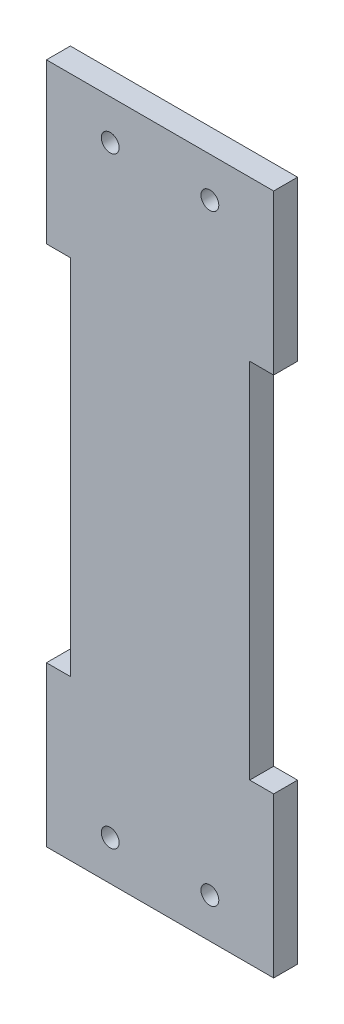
ISO-10303-21;
HEADER;
FILE_DESCRIPTION(('STEP AP214'),'2;1');
FILE_NAME('part.step','',(''),(''),'','','');
FILE_SCHEMA(('AUTOMOTIVE_DESIGN { 1 0 10303 214 1 1 1 1 }'));
ENDSEC;
DATA;
#1=APPLICATION_CONTEXT('core data for automotive mechanical design processes');
#2=APPLICATION_PROTOCOL_DEFINITION('international standard','automotive_design',2000,#1);
#3=PRODUCT_CONTEXT('',#1,'mechanical');
#4=PRODUCT('Part','Part','',(#3));
#5=PRODUCT_RELATED_PRODUCT_CATEGORY('part','',(#4));
#6=PRODUCT_DEFINITION_FORMATION('','',#4);
#7=PRODUCT_DEFINITION_CONTEXT('part definition',#1,'design');
#8=PRODUCT_DEFINITION('design','',#6,#7);
#9=PRODUCT_DEFINITION_SHAPE('','',#8);
#10=(LENGTH_UNIT() NAMED_UNIT(*) SI_UNIT(.MILLI.,.METRE.));
#11=(NAMED_UNIT(*) PLANE_ANGLE_UNIT() SI_UNIT($,.RADIAN.));
#12=(NAMED_UNIT(*) SI_UNIT($,.STERADIAN.) SOLID_ANGLE_UNIT());
#13=UNCERTAINTY_MEASURE_WITH_UNIT(LENGTH_MEASURE(1.E-05),#10,'distance_accuracy_value','');
#14=(GEOMETRIC_REPRESENTATION_CONTEXT(3) GLOBAL_UNCERTAINTY_ASSIGNED_CONTEXT((#13)) GLOBAL_UNIT_ASSIGNED_CONTEXT((#10,
#11,#12)) REPRESENTATION_CONTEXT('',''));
#15=CARTESIAN_POINT('',(0.,0.,0.));
#16=DIRECTION('',(0.,0.,1.));
#17=DIRECTION('',(1.,0.,0.));
#18=AXIS2_PLACEMENT_3D('',#15,#16,#17);
#19=CARTESIAN_POINT('',(0.,0.,6.));
#20=DIRECTION('',(0.,0.,1.));
#21=DIRECTION('',(1.,0.,0.));
#22=AXIS2_PLACEMENT_3D('',#19,#20,#21);
#23=PLANE('',#22);
#24=CARTESIAN_POINT('',(12.5,-75.5,6.));
#25=DIRECTION('',(0.,0.,-1.));
#26=DIRECTION('',(-1.,0.,0.));
#27=AXIS2_PLACEMENT_3D('',#24,#25,#26);
#28=CIRCLE('',#27,2.23466812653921);
#29=CARTESIAN_POINT('',(10.2653318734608,-75.5,6.));
#30=VERTEX_POINT('',#29);
#31=EDGE_CURVE('E188',#30,#30,#28,.T.);
#32=ORIENTED_EDGE('',*,*,#31,.T.);
#33=EDGE_LOOP('',(#32));
#34=FACE_BOUND('',#33,.T.);
#35=CARTESIAN_POINT('',(-12.5,-75.5,6.));
#36=DIRECTION('',(0.,0.,1.));
#37=DIRECTION('',(1.,0.,0.));
#38=AXIS2_PLACEMENT_3D('',#35,#36,#37);
#39=CIRCLE('',#38,2.23466812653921);
#40=CARTESIAN_POINT('',(-10.2653318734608,-75.5,6.));
#41=VERTEX_POINT('',#40);
#42=EDGE_CURVE('E187',#41,#41,#39,.T.);
#43=ORIENTED_EDGE('',*,*,#42,.F.);
#44=EDGE_LOOP('',(#43));
#45=FACE_BOUND('',#44,.T.);
#46=DIRECTION('',(1.,0.,0.));
#47=VECTOR('',#46,1.);
#48=CARTESIAN_POINT('',(-22.5,-85.5,6.));
#49=LINE('',#48,#47);
#50=CARTESIAN_POINT('',(-28.5,-85.5,6.));
#51=VERTEX_POINT('',#50);
#52=CARTESIAN_POINT('',(28.5,-85.5,6.));
#53=VERTEX_POINT('',#52);
#54=EDGE_CURVE('E11',#51,#53,#49,.T.);
#55=ORIENTED_EDGE('',*,*,#54,.T.);
#56=DIRECTION('',(0.,1.,0.));
#57=VECTOR('',#56,1.);
#58=CARTESIAN_POINT('',(28.5,-85.5,6.));
#59=LINE('',#58,#57);
#60=CARTESIAN_POINT('',(28.5,-45.5,6.));
#61=VERTEX_POINT('',#60);
#62=EDGE_CURVE('E257',#53,#61,#59,.T.);
#63=ORIENTED_EDGE('',*,*,#62,.T.);
#64=DIRECTION('',(-1.,0.,0.));
#65=VECTOR('',#64,1.);
#66=CARTESIAN_POINT('',(22.5,-45.5,6.));
#67=LINE('',#66,#65);
#68=CARTESIAN_POINT('',(22.5,-45.5,6.));
#69=VERTEX_POINT('',#68);
#70=EDGE_CURVE('E230',#61,#69,#67,.T.);
#71=ORIENTED_EDGE('',*,*,#70,.T.);
#72=DIRECTION('',(0.,1.,0.));
#73=VECTOR('',#72,1.);
#74=CARTESIAN_POINT('',(22.5,85.5,6.));
#75=LINE('',#74,#73);
#76=CARTESIAN_POINT('',(22.5,45.5,6.));
#77=VERTEX_POINT('',#76);
#78=EDGE_CURVE('E37',#69,#77,#75,.T.);
#79=ORIENTED_EDGE('',*,*,#78,.T.);
#80=DIRECTION('',(-1.,0.,0.));
#81=VECTOR('',#80,1.);
#82=CARTESIAN_POINT('',(22.5,45.5,6.));
#83=LINE('',#82,#81);
#84=CARTESIAN_POINT('',(28.5,45.5,6.));
#85=VERTEX_POINT('',#84);
#86=EDGE_CURVE('E171',#85,#77,#83,.T.);
#87=ORIENTED_EDGE('',*,*,#86,.F.);
#88=DIRECTION('',(0.,-1.,0.));
#89=VECTOR('',#88,1.);
#90=CARTESIAN_POINT('',(28.5,85.5,6.));
#91=LINE('',#90,#89);
#92=CARTESIAN_POINT('',(28.5,85.5,6.));
#93=VERTEX_POINT('',#92);
#94=EDGE_CURVE('E168',#93,#85,#91,.T.);
#95=ORIENTED_EDGE('',*,*,#94,.F.);
#96=DIRECTION('',(-1.,0.,0.));
#97=VECTOR('',#96,1.);
#98=CARTESIAN_POINT('',(-22.5,85.5,6.));
#99=LINE('',#98,#97);
#100=CARTESIAN_POINT('',(-28.5,85.5,6.));
#101=VERTEX_POINT('',#100);
#102=EDGE_CURVE('E221',#93,#101,#99,.T.);
#103=ORIENTED_EDGE('',*,*,#102,.T.);
#104=DIRECTION('',(0.,-1.,0.));
#105=VECTOR('',#104,1.);
#106=CARTESIAN_POINT('',(-28.5,85.5,6.));
#107=LINE('',#106,#105);
#108=CARTESIAN_POINT('',(-28.5,45.5,6.));
#109=VERTEX_POINT('',#108);
#110=EDGE_CURVE('E195',#101,#109,#107,.T.);
#111=ORIENTED_EDGE('',*,*,#110,.T.);
#112=DIRECTION('',(1.,0.,0.));
#113=VECTOR('',#112,1.);
#114=CARTESIAN_POINT('',(-22.5,45.5,6.));
#115=LINE('',#114,#113);
#116=CARTESIAN_POINT('',(-22.5,45.5,6.));
#117=VERTEX_POINT('',#116);
#118=EDGE_CURVE('E202',#109,#117,#115,.T.);
#119=ORIENTED_EDGE('',*,*,#118,.T.);
#120=DIRECTION('',(0.,-1.,0.));
#121=VECTOR('',#120,1.);
#122=CARTESIAN_POINT('',(-22.5,85.5,6.));
#123=LINE('',#122,#121);
#124=CARTESIAN_POINT('',(-22.5,-45.5,6.));
#125=VERTEX_POINT('',#124);
#126=EDGE_CURVE('E43',#117,#125,#123,.T.);
#127=ORIENTED_EDGE('',*,*,#126,.T.);
#128=DIRECTION('',(1.,0.,0.));
#129=VECTOR('',#128,1.);
#130=CARTESIAN_POINT('',(-22.5,-45.5,6.));
#131=LINE('',#130,#129);
#132=CARTESIAN_POINT('',(-28.5,-45.5,6.));
#133=VERTEX_POINT('',#132);
#134=EDGE_CURVE('E140',#133,#125,#131,.T.);
#135=ORIENTED_EDGE('',*,*,#134,.F.);
#136=DIRECTION('',(0.,1.,0.));
#137=VECTOR('',#136,1.);
#138=CARTESIAN_POINT('',(-28.5,-85.5,6.));
#139=LINE('',#138,#137);
#140=EDGE_CURVE('E134',#51,#133,#139,.T.);
#141=ORIENTED_EDGE('',*,*,#140,.F.);
#142=EDGE_LOOP('',(#55,#63,#71,#79,#87,#95,#103,#111,#119,#127,#135,#141));
#143=FACE_BOUND('',#142,.T.);
#144=CARTESIAN_POINT('',(12.5,75.5,6.));
#145=DIRECTION('',(0.,0.,1.));
#146=DIRECTION('',(-1.,0.,0.));
#147=AXIS2_PLACEMENT_3D('',#144,#145,#146);
#148=CIRCLE('',#147,2.23466812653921);
#149=CARTESIAN_POINT('',(10.2653318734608,75.5,6.));
#150=VERTEX_POINT('',#149);
#151=EDGE_CURVE('E270',#150,#150,#148,.T.);
#152=ORIENTED_EDGE('',*,*,#151,.F.);
#153=EDGE_LOOP('',(#152));
#154=FACE_BOUND('',#153,.T.);
#155=CARTESIAN_POINT('',(-12.5,75.5,6.));
#156=DIRECTION('',(0.,0.,-1.));
#157=DIRECTION('',(1.,0.,0.));
#158=AXIS2_PLACEMENT_3D('',#155,#156,#157);
#159=CIRCLE('',#158,2.23466812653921);
#160=CARTESIAN_POINT('',(-10.2653318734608,75.5,6.));
#161=VERTEX_POINT('',#160);
#162=EDGE_CURVE('E276',#161,#161,#159,.T.);
#163=ORIENTED_EDGE('',*,*,#162,.T.);
#164=EDGE_LOOP('',(#163));
#165=FACE_BOUND('',#164,.T.);
#166=ADVANCED_FACE('F33',(#34,#45,#143,#154,#165),#23,.T.);
#167=CARTESIAN_POINT('',(0.,0.,0.));
#168=DIRECTION('',(0.,0.,1.));
#169=DIRECTION('',(1.,0.,0.));
#170=AXIS2_PLACEMENT_3D('',#167,#168,#169);
#171=PLANE('',#170);
#172=CARTESIAN_POINT('',(12.5,-75.5,0.));
#173=DIRECTION('',(0.,0.,-1.));
#174=DIRECTION('',(-1.,0.,0.));
#175=AXIS2_PLACEMENT_3D('',#172,#173,#174);
#176=CIRCLE('',#175,2.23466812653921);
#177=CARTESIAN_POINT('',(10.2653318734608,-75.5,0.));
#178=VERTEX_POINT('',#177);
#179=EDGE_CURVE('E184',#178,#178,#176,.T.);
#180=ORIENTED_EDGE('',*,*,#179,.F.);
#181=EDGE_LOOP('',(#180));
#182=FACE_BOUND('',#181,.T.);
#183=CARTESIAN_POINT('',(-12.5,-75.5,0.));
#184=DIRECTION('',(0.,0.,1.));
#185=DIRECTION('',(1.,0.,0.));
#186=AXIS2_PLACEMENT_3D('',#183,#184,#185);
#187=CIRCLE('',#186,2.23466812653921);
#188=CARTESIAN_POINT('',(-10.2653318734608,-75.5,0.));
#189=VERTEX_POINT('',#188);
#190=EDGE_CURVE('E192',#189,#189,#187,.T.);
#191=ORIENTED_EDGE('',*,*,#190,.T.);
#192=EDGE_LOOP('',(#191));
#193=FACE_BOUND('',#192,.T.);
#194=DIRECTION('',(0.,1.,0.));
#195=VECTOR('',#194,1.);
#196=CARTESIAN_POINT('',(22.5,85.5,0.));
#197=LINE('',#196,#195);
#198=CARTESIAN_POINT('',(22.5,-45.5,0.));
#199=VERTEX_POINT('',#198);
#200=CARTESIAN_POINT('',(22.5,45.5,0.));
#201=VERTEX_POINT('',#200);
#202=EDGE_CURVE('E152',#199,#201,#197,.T.);
#203=ORIENTED_EDGE('',*,*,#202,.F.);
#204=DIRECTION('',(-1.,0.,0.));
#205=VECTOR('',#204,1.);
#206=CARTESIAN_POINT('',(22.5,-45.5,0.));
#207=LINE('',#206,#205);
#208=CARTESIAN_POINT('',(28.5,-45.5,0.));
#209=VERTEX_POINT('',#208);
#210=EDGE_CURVE('E252',#209,#199,#207,.T.);
#211=ORIENTED_EDGE('',*,*,#210,.F.);
#212=DIRECTION('',(0.,1.,0.));
#213=VECTOR('',#212,1.);
#214=CARTESIAN_POINT('',(28.5,-85.5,0.));
#215=LINE('',#214,#213);
#216=CARTESIAN_POINT('',(28.5,-85.5,0.));
#217=VERTEX_POINT('',#216);
#218=EDGE_CURVE('E256',#217,#209,#215,.T.);
#219=ORIENTED_EDGE('',*,*,#218,.F.);
#220=DIRECTION('',(1.,0.,0.));
#221=VECTOR('',#220,1.);
#222=CARTESIAN_POINT('',(-22.5,-85.5,0.));
#223=LINE('',#222,#221);
#224=CARTESIAN_POINT('',(-28.5,-85.5,0.));
#225=VERTEX_POINT('',#224);
#226=EDGE_CURVE('E148',#225,#217,#223,.T.);
#227=ORIENTED_EDGE('',*,*,#226,.F.);
#228=DIRECTION('',(0.,1.,0.));
#229=VECTOR('',#228,1.);
#230=CARTESIAN_POINT('',(-28.5,-85.5,0.));
#231=LINE('',#230,#229);
#232=CARTESIAN_POINT('',(-28.5,-45.5,0.));
#233=VERTEX_POINT('',#232);
#234=EDGE_CURVE('E130',#225,#233,#231,.T.);
#235=ORIENTED_EDGE('',*,*,#234,.T.);
#236=DIRECTION('',(1.,0.,0.));
#237=VECTOR('',#236,1.);
#238=CARTESIAN_POINT('',(-22.5,-45.5,0.));
#239=LINE('',#238,#237);
#240=CARTESIAN_POINT('',(-22.5,-45.5,0.));
#241=VERTEX_POINT('',#240);
#242=EDGE_CURVE('E121',#233,#241,#239,.T.);
#243=ORIENTED_EDGE('',*,*,#242,.T.);
#244=DIRECTION('',(0.,-1.,0.));
#245=VECTOR('',#244,1.);
#246=CARTESIAN_POINT('',(-22.5,85.5,0.));
#247=LINE('',#246,#245);
#248=CARTESIAN_POINT('',(-22.5,45.5,0.));
#249=VERTEX_POINT('',#248);
#250=EDGE_CURVE('E127',#249,#241,#247,.T.);
#251=ORIENTED_EDGE('',*,*,#250,.F.);
#252=DIRECTION('',(1.,0.,0.));
#253=VECTOR('',#252,1.);
#254=CARTESIAN_POINT('',(-22.5,45.5,0.));
#255=LINE('',#254,#253);
#256=CARTESIAN_POINT('',(-28.5,45.5,0.));
#257=VERTEX_POINT('',#256);
#258=EDGE_CURVE('E201',#257,#249,#255,.T.);
#259=ORIENTED_EDGE('',*,*,#258,.F.);
#260=DIRECTION('',(0.,-1.,0.));
#261=VECTOR('',#260,1.);
#262=CARTESIAN_POINT('',(-28.5,85.5,0.));
#263=LINE('',#262,#261);
#264=CARTESIAN_POINT('',(-28.5,85.5,0.));
#265=VERTEX_POINT('',#264);
#266=EDGE_CURVE('E198',#265,#257,#263,.T.);
#267=ORIENTED_EDGE('',*,*,#266,.F.);
#268=DIRECTION('',(-1.,0.,0.));
#269=VECTOR('',#268,1.);
#270=CARTESIAN_POINT('',(-22.5,85.5,0.));
#271=LINE('',#270,#269);
#272=CARTESIAN_POINT('',(28.5,85.5,0.));
#273=VERTEX_POINT('',#272);
#274=EDGE_CURVE('E149',#273,#265,#271,.T.);
#275=ORIENTED_EDGE('',*,*,#274,.F.);
#276=DIRECTION('',(0.,-1.,0.));
#277=VECTOR('',#276,1.);
#278=CARTESIAN_POINT('',(28.5,85.5,0.));
#279=LINE('',#278,#277);
#280=CARTESIAN_POINT('',(28.5,45.5,0.));
#281=VERTEX_POINT('',#280);
#282=EDGE_CURVE('E167',#273,#281,#279,.T.);
#283=ORIENTED_EDGE('',*,*,#282,.T.);
#284=DIRECTION('',(-1.,0.,0.));
#285=VECTOR('',#284,1.);
#286=CARTESIAN_POINT('',(22.5,45.5,0.));
#287=LINE('',#286,#285);
#288=EDGE_CURVE('E164',#281,#201,#287,.T.);
#289=ORIENTED_EDGE('',*,*,#288,.T.);
#290=EDGE_LOOP('',(#203,#211,#219,#227,#235,#243,#251,#259,#267,#275,#283,#289));
#291=FACE_BOUND('',#290,.T.);
#292=CARTESIAN_POINT('',(12.5,75.5,0.));
#293=DIRECTION('',(0.,0.,1.));
#294=DIRECTION('',(-1.,0.,0.));
#295=AXIS2_PLACEMENT_3D('',#292,#293,#294);
#296=CIRCLE('',#295,2.23466812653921);
#297=CARTESIAN_POINT('',(10.2653318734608,75.5,0.));
#298=VERTEX_POINT('',#297);
#299=EDGE_CURVE('E268',#298,#298,#296,.T.);
#300=ORIENTED_EDGE('',*,*,#299,.T.);
#301=EDGE_LOOP('',(#300));
#302=FACE_BOUND('',#301,.T.);
#303=CARTESIAN_POINT('',(-12.5,75.5,0.));
#304=DIRECTION('',(0.,0.,-1.));
#305=DIRECTION('',(1.,0.,0.));
#306=AXIS2_PLACEMENT_3D('',#303,#304,#305);
#307=CIRCLE('',#306,2.23466812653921);
#308=CARTESIAN_POINT('',(-10.2653318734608,75.5,0.));
#309=VERTEX_POINT('',#308);
#310=EDGE_CURVE('E273',#309,#309,#307,.T.);
#311=ORIENTED_EDGE('',*,*,#310,.F.);
#312=EDGE_LOOP('',(#311));
#313=FACE_BOUND('',#312,.T.);
#314=ADVANCED_FACE('F123',(#182,#193,#291,#302,#313),#171,.F.);
#315=CARTESIAN_POINT('',(-22.5,85.5,6.));
#316=DIRECTION('',(1.,0.,0.));
#317=DIRECTION('',(0.,1.,0.));
#318=AXIS2_PLACEMENT_3D('',#315,#316,#317);
#319=PLANE('',#318);
#320=DIRECTION('',(0.,0.,1.));
#321=VECTOR('',#320,1.);
#322=CARTESIAN_POINT('',(-22.5,-45.5,0.));
#323=LINE('',#322,#321);
#324=EDGE_CURVE('E137',#241,#125,#323,.T.);
#325=ORIENTED_EDGE('',*,*,#324,.T.);
#326=ORIENTED_EDGE('',*,*,#126,.F.);
#327=DIRECTION('',(0.,0.,1.));
#328=VECTOR('',#327,1.);
#329=CARTESIAN_POINT('',(-22.5,45.5,0.));
#330=LINE('',#329,#328);
#331=EDGE_CURVE('E147',#249,#117,#330,.T.);
#332=ORIENTED_EDGE('',*,*,#331,.F.);
#333=ORIENTED_EDGE('',*,*,#250,.T.);
#334=EDGE_LOOP('',(#325,#326,#332,#333));
#335=FACE_BOUND('',#334,.T.);
#336=ADVANCED_FACE('F145',(#335),#319,.F.);
#337=CARTESIAN_POINT('',(22.5,85.5,6.));
#338=DIRECTION('',(-1.,0.,0.));
#339=DIRECTION('',(0.,-1.,0.));
#340=AXIS2_PLACEMENT_3D('',#337,#338,#339);
#341=PLANE('',#340);
#342=ORIENTED_EDGE('',*,*,#78,.F.);
#343=DIRECTION('',(0.,0.,1.));
#344=VECTOR('',#343,1.);
#345=CARTESIAN_POINT('',(22.5,-45.5,0.));
#346=LINE('',#345,#344);
#347=EDGE_CURVE('E54',#199,#69,#346,.T.);
#348=ORIENTED_EDGE('',*,*,#347,.F.);
#349=ORIENTED_EDGE('',*,*,#202,.T.);
#350=DIRECTION('',(0.,0.,1.));
#351=VECTOR('',#350,1.);
#352=CARTESIAN_POINT('',(22.5,45.5,0.));
#353=LINE('',#352,#351);
#354=EDGE_CURVE('E174',#201,#77,#353,.T.);
#355=ORIENTED_EDGE('',*,*,#354,.T.);
#356=EDGE_LOOP('',(#342,#348,#349,#355));
#357=FACE_BOUND('',#356,.T.);
#358=ADVANCED_FACE('F35',(#357),#341,.F.);
#359=CARTESIAN_POINT('',(-22.5,85.5,6.));
#360=DIRECTION('',(0.,-1.,0.));
#361=DIRECTION('',(0.,0.,-1.));
#362=AXIS2_PLACEMENT_3D('',#359,#360,#361);
#363=PLANE('',#362);
#364=ORIENTED_EDGE('',*,*,#274,.T.);
#365=DIRECTION('',(0.,0.,1.));
#366=VECTOR('',#365,1.);
#367=CARTESIAN_POINT('',(-28.5,85.5,0.));
#368=LINE('',#367,#366);
#369=EDGE_CURVE('E213',#265,#101,#368,.T.);
#370=ORIENTED_EDGE('',*,*,#369,.T.);
#371=ORIENTED_EDGE('',*,*,#102,.F.);
#372=DIRECTION('',(0.,0.,1.));
#373=VECTOR('',#372,1.);
#374=CARTESIAN_POINT('',(28.5,85.5,0.));
#375=LINE('',#374,#373);
#376=EDGE_CURVE('E191',#273,#93,#375,.T.);
#377=ORIENTED_EDGE('',*,*,#376,.F.);
#378=EDGE_LOOP('',(#364,#370,#371,#377));
#379=FACE_BOUND('',#378,.T.);
#380=ADVANCED_FACE('F303',(#379),#363,.F.);
#381=CARTESIAN_POINT('',(-22.5,-85.5,6.));
#382=DIRECTION('',(0.,1.,0.));
#383=DIRECTION('',(0.,0.,1.));
#384=AXIS2_PLACEMENT_3D('',#381,#382,#383);
#385=PLANE('',#384);
#386=ORIENTED_EDGE('',*,*,#226,.T.);
#387=DIRECTION('',(0.,0.,1.));
#388=VECTOR('',#387,1.);
#389=CARTESIAN_POINT('',(28.5,-85.5,0.));
#390=LINE('',#389,#388);
#391=EDGE_CURVE('E248',#217,#53,#390,.T.);
#392=ORIENTED_EDGE('',*,*,#391,.T.);
#393=ORIENTED_EDGE('',*,*,#54,.F.);
#394=DIRECTION('',(0.,0.,1.));
#395=VECTOR('',#394,1.);
#396=CARTESIAN_POINT('',(-28.5,-85.5,0.));
#397=LINE('',#396,#395);
#398=EDGE_CURVE('E259',#225,#51,#397,.T.);
#399=ORIENTED_EDGE('',*,*,#398,.F.);
#400=EDGE_LOOP('',(#386,#392,#393,#399));
#401=FACE_BOUND('',#400,.T.);
#402=ADVANCED_FACE('F300',(#401),#385,.F.);
#403=CARTESIAN_POINT('',(-22.5,45.5,0.));
#404=DIRECTION('',(0.,-1.,0.));
#405=DIRECTION('',(1.,0.,0.));
#406=AXIS2_PLACEMENT_3D('',#403,#404,#405);
#407=PLANE('',#406);
#408=ORIENTED_EDGE('',*,*,#118,.F.);
#409=DIRECTION('',(0.,0.,1.));
#410=VECTOR('',#409,1.);
#411=CARTESIAN_POINT('',(-28.5,45.5,0.));
#412=LINE('',#411,#410);
#413=EDGE_CURVE('E207',#257,#109,#412,.T.);
#414=ORIENTED_EDGE('',*,*,#413,.F.);
#415=ORIENTED_EDGE('',*,*,#258,.T.);
#416=ORIENTED_EDGE('',*,*,#331,.T.);
#417=EDGE_LOOP('',(#408,#414,#415,#416));
#418=FACE_BOUND('',#417,.T.);
#419=ADVANCED_FACE('F302',(#418),#407,.T.);
#420=CARTESIAN_POINT('',(-28.5,85.5,0.));
#421=DIRECTION('',(-1.,0.,0.));
#422=DIRECTION('',(0.,-1.,0.));
#423=AXIS2_PLACEMENT_3D('',#420,#421,#422);
#424=PLANE('',#423);
#425=ORIENTED_EDGE('',*,*,#110,.F.);
#426=ORIENTED_EDGE('',*,*,#369,.F.);
#427=ORIENTED_EDGE('',*,*,#266,.T.);
#428=ORIENTED_EDGE('',*,*,#413,.T.);
#429=EDGE_LOOP('',(#425,#426,#427,#428));
#430=FACE_BOUND('',#429,.T.);
#431=ADVANCED_FACE('F310',(#430),#424,.T.);
#432=CARTESIAN_POINT('',(-12.5,-75.5,0.));
#433=DIRECTION('',(0.,0.,1.));
#434=DIRECTION('',(1.,0.,0.));
#435=AXIS2_PLACEMENT_3D('',#432,#433,#434);
#436=CYLINDRICAL_SURFACE('',#435,2.23466812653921);
#437=ORIENTED_EDGE('',*,*,#190,.F.);
#438=EDGE_LOOP('',(#437));
#439=FACE_BOUND('',#438,.T.);
#440=ORIENTED_EDGE('',*,*,#42,.T.);
#441=EDGE_LOOP('',(#440));
#442=FACE_BOUND('',#441,.T.);
#443=ADVANCED_FACE('F317',(#439,#442),#436,.F.);
#444=CARTESIAN_POINT('',(12.5,-75.5,0.));
#445=DIRECTION('',(0.,0.,1.));
#446=DIRECTION('',(1.,0.,0.));
#447=AXIS2_PLACEMENT_3D('',#444,#445,#446);
#448=CYLINDRICAL_SURFACE('',#447,2.23466812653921);
#449=ORIENTED_EDGE('',*,*,#179,.T.);
#450=EDGE_LOOP('',(#449));
#451=FACE_BOUND('',#450,.T.);
#452=ORIENTED_EDGE('',*,*,#31,.F.);
#453=EDGE_LOOP('',(#452));
#454=FACE_BOUND('',#453,.T.);
#455=ADVANCED_FACE('F321',(#451,#454),#448,.F.);
#456=CARTESIAN_POINT('',(28.5,85.5,0.));
#457=DIRECTION('',(-1.,0.,0.));
#458=DIRECTION('',(0.,-1.,0.));
#459=AXIS2_PLACEMENT_3D('',#456,#457,#458);
#460=PLANE('',#459);
#461=ORIENTED_EDGE('',*,*,#94,.T.);
#462=DIRECTION('',(0.,0.,1.));
#463=VECTOR('',#462,1.);
#464=CARTESIAN_POINT('',(28.5,45.5,0.));
#465=LINE('',#464,#463);
#466=EDGE_CURVE('E177',#281,#85,#465,.T.);
#467=ORIENTED_EDGE('',*,*,#466,.F.);
#468=ORIENTED_EDGE('',*,*,#282,.F.);
#469=ORIENTED_EDGE('',*,*,#376,.T.);
#470=EDGE_LOOP('',(#461,#467,#468,#469));
#471=FACE_BOUND('',#470,.T.);
#472=ADVANCED_FACE('F245',(#471),#460,.F.);
#473=CARTESIAN_POINT('',(22.5,45.5,0.));
#474=DIRECTION('',(0.,1.,0.));
#475=DIRECTION('',(-1.,0.,0.));
#476=AXIS2_PLACEMENT_3D('',#473,#474,#475);
#477=PLANE('',#476);
#478=ORIENTED_EDGE('',*,*,#86,.T.);
#479=ORIENTED_EDGE('',*,*,#354,.F.);
#480=ORIENTED_EDGE('',*,*,#288,.F.);
#481=ORIENTED_EDGE('',*,*,#466,.T.);
#482=EDGE_LOOP('',(#478,#479,#480,#481));
#483=FACE_BOUND('',#482,.T.);
#484=ADVANCED_FACE('F234',(#483),#477,.F.);
#485=CARTESIAN_POINT('',(22.5,-45.5,0.));
#486=DIRECTION('',(0.,1.,0.));
#487=DIRECTION('',(-1.,0.,0.));
#488=AXIS2_PLACEMENT_3D('',#485,#486,#487);
#489=PLANE('',#488);
#490=ORIENTED_EDGE('',*,*,#70,.F.);
#491=DIRECTION('',(0.,0.,1.));
#492=VECTOR('',#491,1.);
#493=CARTESIAN_POINT('',(28.5,-45.5,0.));
#494=LINE('',#493,#492);
#495=EDGE_CURVE('E251',#209,#61,#494,.T.);
#496=ORIENTED_EDGE('',*,*,#495,.F.);
#497=ORIENTED_EDGE('',*,*,#210,.T.);
#498=ORIENTED_EDGE('',*,*,#347,.T.);
#499=EDGE_LOOP('',(#490,#496,#497,#498));
#500=FACE_BOUND('',#499,.T.);
#501=ADVANCED_FACE('F328',(#500),#489,.T.);
#502=CARTESIAN_POINT('',(28.5,-85.5,0.));
#503=DIRECTION('',(1.,0.,0.));
#504=DIRECTION('',(0.,1.,0.));
#505=AXIS2_PLACEMENT_3D('',#502,#503,#504);
#506=PLANE('',#505);
#507=ORIENTED_EDGE('',*,*,#62,.F.);
#508=ORIENTED_EDGE('',*,*,#391,.F.);
#509=ORIENTED_EDGE('',*,*,#218,.T.);
#510=ORIENTED_EDGE('',*,*,#495,.T.);
#511=EDGE_LOOP('',(#507,#508,#509,#510));
#512=FACE_BOUND('',#511,.T.);
#513=ADVANCED_FACE('F331',(#512),#506,.T.);
#514=CARTESIAN_POINT('',(-28.5,-85.5,0.));
#515=DIRECTION('',(1.,0.,0.));
#516=DIRECTION('',(0.,1.,0.));
#517=AXIS2_PLACEMENT_3D('',#514,#515,#516);
#518=PLANE('',#517);
#519=ORIENTED_EDGE('',*,*,#140,.T.);
#520=DIRECTION('',(0.,0.,1.));
#521=VECTOR('',#520,1.);
#522=CARTESIAN_POINT('',(-28.5,-45.5,0.));
#523=LINE('',#522,#521);
#524=EDGE_CURVE('E143',#233,#133,#523,.T.);
#525=ORIENTED_EDGE('',*,*,#524,.F.);
#526=ORIENTED_EDGE('',*,*,#234,.F.);
#527=ORIENTED_EDGE('',*,*,#398,.T.);
#528=EDGE_LOOP('',(#519,#525,#526,#527));
#529=FACE_BOUND('',#528,.T.);
#530=ADVANCED_FACE('F334',(#529),#518,.F.);
#531=CARTESIAN_POINT('',(-22.5,-45.5,0.));
#532=DIRECTION('',(0.,-1.,0.));
#533=DIRECTION('',(1.,0.,0.));
#534=AXIS2_PLACEMENT_3D('',#531,#532,#533);
#535=PLANE('',#534);
#536=ORIENTED_EDGE('',*,*,#134,.T.);
#537=ORIENTED_EDGE('',*,*,#324,.F.);
#538=ORIENTED_EDGE('',*,*,#242,.F.);
#539=ORIENTED_EDGE('',*,*,#524,.T.);
#540=EDGE_LOOP('',(#536,#537,#538,#539));
#541=FACE_BOUND('',#540,.T.);
#542=ADVANCED_FACE('F138',(#541),#535,.F.);
#543=CARTESIAN_POINT('',(12.5,75.5,0.));
#544=DIRECTION('',(0.,0.,1.));
#545=DIRECTION('',(1.,0.,0.));
#546=AXIS2_PLACEMENT_3D('',#543,#544,#545);
#547=CYLINDRICAL_SURFACE('',#546,2.23466812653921);
#548=ORIENTED_EDGE('',*,*,#299,.F.);
#549=EDGE_LOOP('',(#548));
#550=FACE_BOUND('',#549,.T.);
#551=ORIENTED_EDGE('',*,*,#151,.T.);
#552=EDGE_LOOP('',(#551));
#553=FACE_BOUND('',#552,.T.);
#554=ADVANCED_FACE('F341',(#550,#553),#547,.F.);
#555=CARTESIAN_POINT('',(-12.5,75.5,0.));
#556=DIRECTION('',(0.,0.,1.));
#557=DIRECTION('',(1.,0.,0.));
#558=AXIS2_PLACEMENT_3D('',#555,#556,#557);
#559=CYLINDRICAL_SURFACE('',#558,2.23466812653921);
#560=ORIENTED_EDGE('',*,*,#310,.T.);
#561=EDGE_LOOP('',(#560));
#562=FACE_BOUND('',#561,.T.);
#563=ORIENTED_EDGE('',*,*,#162,.F.);
#564=EDGE_LOOP('',(#563));
#565=FACE_BOUND('',#564,.T.);
#566=ADVANCED_FACE('F282',(#562,#565),#559,.F.);
#567=CLOSED_SHELL('',(#166,#314,#336,#358,#380,#402,#419,#431,#443,#455,#472,#484,#501,#513,
#530,#542,#554,#566));
#568=MANIFOLD_SOLID_BREP('B2',#567);
#569=ADVANCED_BREP_SHAPE_REPRESENTATION('',(#18,#568),#14);
#570=SHAPE_DEFINITION_REPRESENTATION(#9,#569);
ENDSEC;
END-ISO-10303-21;
